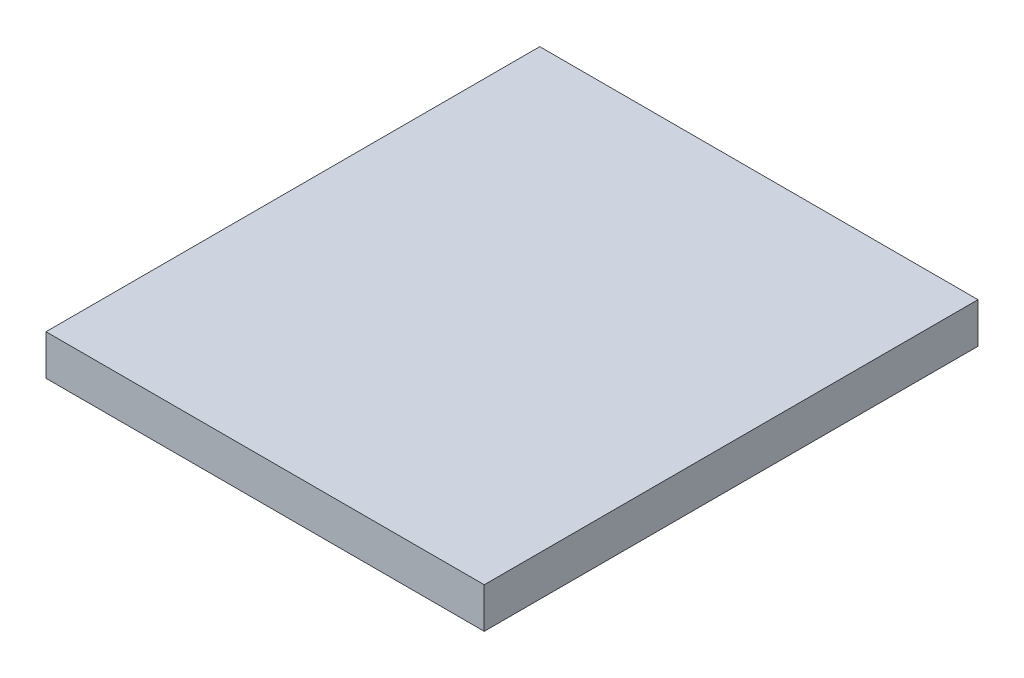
ISO-10303-21;
HEADER;
FILE_DESCRIPTION(('STEP AP214'),'2;1');
FILE_NAME('part.step','',(''),(''),'','','');
FILE_SCHEMA(('AUTOMOTIVE_DESIGN { 1 0 10303 214 1 1 1 1 }'));
ENDSEC;
DATA;
#1=APPLICATION_CONTEXT('core data for automotive mechanical design processes');
#2=APPLICATION_PROTOCOL_DEFINITION('international standard','automotive_design',2000,#1);
#3=PRODUCT_CONTEXT('',#1,'mechanical');
#4=PRODUCT('Part','Part','',(#3));
#5=PRODUCT_RELATED_PRODUCT_CATEGORY('part','',(#4));
#6=PRODUCT_DEFINITION_FORMATION('','',#4);
#7=PRODUCT_DEFINITION_CONTEXT('part definition',#1,'design');
#8=PRODUCT_DEFINITION('design','',#6,#7);
#9=PRODUCT_DEFINITION_SHAPE('','',#8);
#10=(LENGTH_UNIT() NAMED_UNIT(*) SI_UNIT(.MILLI.,.METRE.));
#11=(NAMED_UNIT(*) PLANE_ANGLE_UNIT() SI_UNIT($,.RADIAN.));
#12=(NAMED_UNIT(*) SI_UNIT($,.STERADIAN.) SOLID_ANGLE_UNIT());
#13=UNCERTAINTY_MEASURE_WITH_UNIT(LENGTH_MEASURE(1.E-05),#10,'distance_accuracy_value','');
#14=(GEOMETRIC_REPRESENTATION_CONTEXT(3) GLOBAL_UNCERTAINTY_ASSIGNED_CONTEXT((#13)) GLOBAL_UNIT_ASSIGNED_CONTEXT((#10,
#11,#12)) REPRESENTATION_CONTEXT('',''));
#15=CARTESIAN_POINT('',(0.,0.,0.));
#16=DIRECTION('',(0.,0.,1.));
#17=DIRECTION('',(1.,0.,0.));
#18=AXIS2_PLACEMENT_3D('',#15,#16,#17);
#19=CARTESIAN_POINT('',(0.,0.,25.4));
#20=DIRECTION('',(1.,0.,0.));
#21=DIRECTION('',(0.,0.,-1.));
#22=AXIS2_PLACEMENT_3D('',#19,#20,#21);
#23=PLANE('',#22);
#24=DIRECTION('',(0.,-1.,0.));
#25=VECTOR('',#24,1.);
#26=CARTESIAN_POINT('',(0.,0.,0.));
#27=LINE('',#26,#25);
#28=CARTESIAN_POINT('',(0.,0.,0.));
#29=VERTEX_POINT('',#28);
#30=CARTESIAN_POINT('',(0.,-2.07643333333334,0.));
#31=VERTEX_POINT('',#30);
#32=EDGE_CURVE('E93',#29,#31,#27,.T.);
#33=ORIENTED_EDGE('',*,*,#32,.T.);
#34=DIRECTION('',(0.,0.,-1.));
#35=VECTOR('',#34,1.);
#36=CARTESIAN_POINT('',(0.,-2.07643333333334,25.4));
#37=LINE('',#36,#35);
#38=CARTESIAN_POINT('',(0.,-2.07643333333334,25.4));
#39=VERTEX_POINT('',#38);
#40=EDGE_CURVE('E11',#39,#31,#37,.T.);
#41=ORIENTED_EDGE('',*,*,#40,.F.);
#42=DIRECTION('',(0.,-1.,0.));
#43=VECTOR('',#42,1.);
#44=CARTESIAN_POINT('',(0.,0.,25.4));
#45=LINE('',#44,#43);
#46=CARTESIAN_POINT('',(0.,0.,25.4));
#47=VERTEX_POINT('',#46);
#48=EDGE_CURVE('E81',#47,#39,#45,.T.);
#49=ORIENTED_EDGE('',*,*,#48,.F.);
#50=DIRECTION('',(0.,0.,-1.));
#51=VECTOR('',#50,1.);
#52=CARTESIAN_POINT('',(0.,0.,25.4));
#53=LINE('',#52,#51);
#54=EDGE_CURVE('E89',#47,#29,#53,.T.);
#55=ORIENTED_EDGE('',*,*,#54,.T.);
#56=EDGE_LOOP('',(#33,#41,#49,#55));
#57=FACE_BOUND('',#56,.T.);
#58=ADVANCED_FACE('F30',(#57),#23,.F.);
#59=CARTESIAN_POINT('',(0.,-2.07643333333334,25.4));
#60=DIRECTION('',(0.,1.,0.));
#61=DIRECTION('',(0.,0.,1.));
#62=AXIS2_PLACEMENT_3D('',#59,#60,#61);
#63=PLANE('',#62);
#64=DIRECTION('',(1.,0.,0.));
#65=VECTOR('',#64,1.);
#66=CARTESIAN_POINT('',(0.,-2.07643333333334,0.));
#67=LINE('',#66,#65);
#68=CARTESIAN_POINT('',(22.5441333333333,-2.07643333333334,0.));
#69=VERTEX_POINT('',#68);
#70=EDGE_CURVE('E85',#31,#69,#67,.T.);
#71=ORIENTED_EDGE('',*,*,#70,.T.);
#72=DIRECTION('',(0.,0.,-1.));
#73=VECTOR('',#72,1.);
#74=CARTESIAN_POINT('',(22.5441333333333,-2.07643333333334,25.4));
#75=LINE('',#74,#73);
#76=CARTESIAN_POINT('',(22.5441333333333,-2.07643333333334,25.4));
#77=VERTEX_POINT('',#76);
#78=EDGE_CURVE('E38',#77,#69,#75,.T.);
#79=ORIENTED_EDGE('',*,*,#78,.F.);
#80=DIRECTION('',(1.,0.,0.));
#81=VECTOR('',#80,1.);
#82=CARTESIAN_POINT('',(0.,-2.07643333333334,25.4));
#83=LINE('',#82,#81);
#84=EDGE_CURVE('E76',#39,#77,#83,.T.);
#85=ORIENTED_EDGE('',*,*,#84,.F.);
#86=ORIENTED_EDGE('',*,*,#40,.T.);
#87=EDGE_LOOP('',(#71,#79,#85,#86));
#88=FACE_BOUND('',#87,.T.);
#89=ADVANCED_FACE('F84',(#88),#63,.F.);
#90=CARTESIAN_POINT('',(22.5441333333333,0.,25.4));
#91=DIRECTION('',(-1.,0.,0.));
#92=DIRECTION('',(0.,0.,1.));
#93=AXIS2_PLACEMENT_3D('',#90,#91,#92);
#94=PLANE('',#93);
#95=DIRECTION('',(0.,1.,0.));
#96=VECTOR('',#95,1.);
#97=CARTESIAN_POINT('',(22.5441333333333,0.,0.));
#98=LINE('',#97,#96);
#99=CARTESIAN_POINT('',(22.5441333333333,0.,0.));
#100=VERTEX_POINT('',#99);
#101=EDGE_CURVE('E63',#69,#100,#98,.T.);
#102=ORIENTED_EDGE('',*,*,#101,.T.);
#103=DIRECTION('',(0.,0.,-1.));
#104=VECTOR('',#103,1.);
#105=CARTESIAN_POINT('',(22.5441333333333,0.,25.4));
#106=LINE('',#105,#104);
#107=CARTESIAN_POINT('',(22.5441333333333,0.,25.4));
#108=VERTEX_POINT('',#107);
#109=EDGE_CURVE('E86',#108,#100,#106,.T.);
#110=ORIENTED_EDGE('',*,*,#109,.F.);
#111=DIRECTION('',(0.,1.,0.));
#112=VECTOR('',#111,1.);
#113=CARTESIAN_POINT('',(22.5441333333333,0.,25.4));
#114=LINE('',#113,#112);
#115=EDGE_CURVE('E79',#77,#108,#114,.T.);
#116=ORIENTED_EDGE('',*,*,#115,.F.);
#117=ORIENTED_EDGE('',*,*,#78,.T.);
#118=EDGE_LOOP('',(#102,#110,#116,#117));
#119=FACE_BOUND('',#118,.T.);
#120=ADVANCED_FACE('F87',(#119),#94,.F.);
#121=CARTESIAN_POINT('',(0.,0.,25.4));
#122=DIRECTION('',(0.,-1.,0.));
#123=DIRECTION('',(0.,0.,-1.));
#124=AXIS2_PLACEMENT_3D('',#121,#122,#123);
#125=PLANE('',#124);
#126=DIRECTION('',(-1.,0.,0.));
#127=VECTOR('',#126,1.);
#128=CARTESIAN_POINT('',(0.,0.,0.));
#129=LINE('',#128,#127);
#130=EDGE_CURVE('E69',#100,#29,#129,.T.);
#131=ORIENTED_EDGE('',*,*,#130,.T.);
#132=ORIENTED_EDGE('',*,*,#54,.F.);
#133=DIRECTION('',(-1.,0.,0.));
#134=VECTOR('',#133,1.);
#135=CARTESIAN_POINT('',(0.,0.,25.4));
#136=LINE('',#135,#134);
#137=EDGE_CURVE('E46',#108,#47,#136,.T.);
#138=ORIENTED_EDGE('',*,*,#137,.F.);
#139=ORIENTED_EDGE('',*,*,#109,.T.);
#140=EDGE_LOOP('',(#131,#132,#138,#139));
#141=FACE_BOUND('',#140,.T.);
#142=ADVANCED_FACE('F100',(#141),#125,.F.);
#143=CARTESIAN_POINT('',(0.,-2.07643333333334,25.4));
#144=DIRECTION('',(0.,0.,1.));
#145=DIRECTION('',(1.,0.,0.));
#146=AXIS2_PLACEMENT_3D('',#143,#144,#145);
#147=PLANE('',#146);
#148=ORIENTED_EDGE('',*,*,#48,.T.);
#149=ORIENTED_EDGE('',*,*,#84,.T.);
#150=ORIENTED_EDGE('',*,*,#115,.T.);
#151=ORIENTED_EDGE('',*,*,#137,.T.);
#152=EDGE_LOOP('',(#148,#149,#150,#151));
#153=FACE_BOUND('',#152,.T.);
#154=ADVANCED_FACE('F77',(#153),#147,.T.);
#155=CARTESIAN_POINT('',(0.,-2.07643333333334,0.));
#156=DIRECTION('',(0.,0.,1.));
#157=DIRECTION('',(1.,0.,0.));
#158=AXIS2_PLACEMENT_3D('',#155,#156,#157);
#159=PLANE('',#158);
#160=ORIENTED_EDGE('',*,*,#32,.F.);
#161=ORIENTED_EDGE('',*,*,#130,.F.);
#162=ORIENTED_EDGE('',*,*,#101,.F.);
#163=ORIENTED_EDGE('',*,*,#70,.F.);
#164=EDGE_LOOP('',(#160,#161,#162,#163));
#165=FACE_BOUND('',#164,.T.);
#166=ADVANCED_FACE('F103',(#165),#159,.F.);
#167=CLOSED_SHELL('',(#58,#89,#120,#142,#154,#166));
#168=MANIFOLD_SOLID_BREP('B2',#167);
#169=ADVANCED_BREP_SHAPE_REPRESENTATION('',(#18,#168),#14);
#170=SHAPE_DEFINITION_REPRESENTATION(#9,#169);
ENDSEC;
END-ISO-10303-21;
